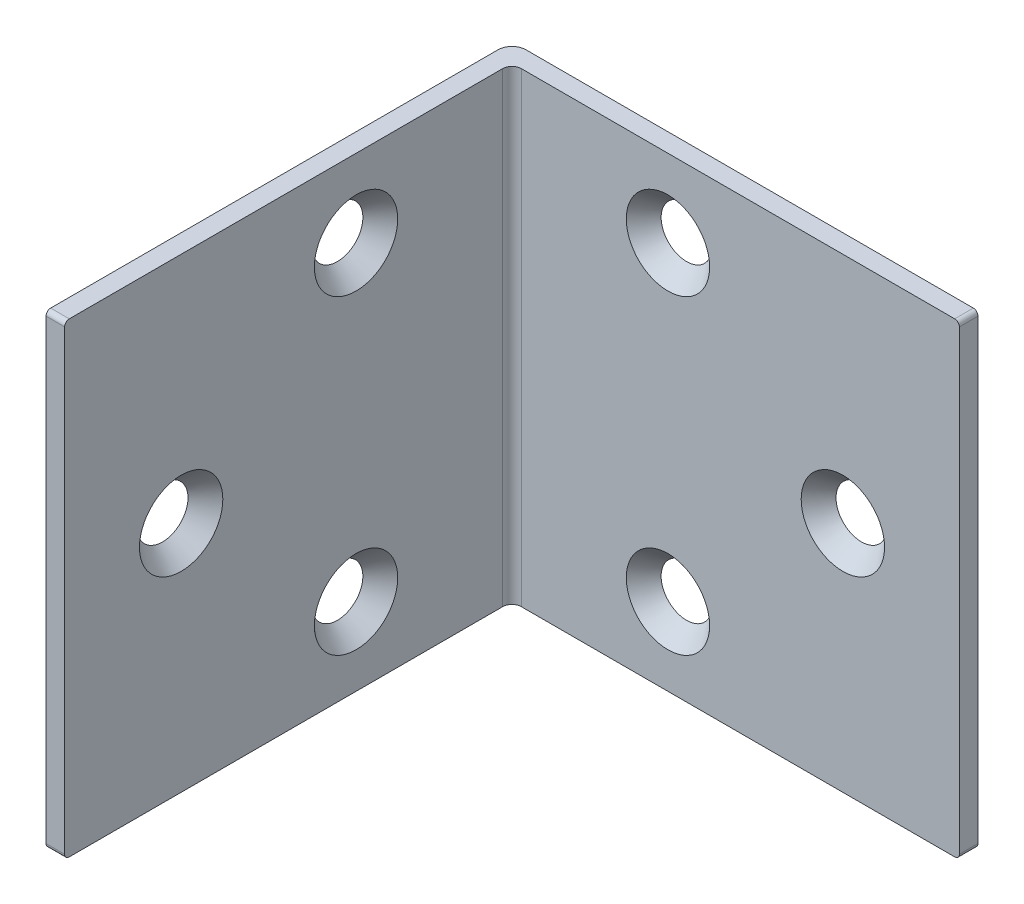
ISO-10303-21;
HEADER;
FILE_DESCRIPTION(('STEP AP214'),'2;1');
FILE_NAME('part.step','',(''),(''),'','','');
FILE_SCHEMA(('AUTOMOTIVE_DESIGN { 1 0 10303 214 1 1 1 1 }'));
ENDSEC;
DATA;
#1=APPLICATION_CONTEXT('core data for automotive mechanical design processes');
#2=APPLICATION_PROTOCOL_DEFINITION('international standard','automotive_design',2000,#1);
#3=PRODUCT_CONTEXT('',#1,'mechanical');
#4=PRODUCT('Part','Part','',(#3));
#5=PRODUCT_RELATED_PRODUCT_CATEGORY('part','',(#4));
#6=PRODUCT_DEFINITION_FORMATION('','',#4);
#7=PRODUCT_DEFINITION_CONTEXT('part definition',#1,'design');
#8=PRODUCT_DEFINITION('design','',#6,#7);
#9=PRODUCT_DEFINITION_SHAPE('','',#8);
#10=(LENGTH_UNIT() NAMED_UNIT(*) SI_UNIT(.MILLI.,.METRE.));
#11=(NAMED_UNIT(*) PLANE_ANGLE_UNIT() SI_UNIT($,.RADIAN.));
#12=(NAMED_UNIT(*) SI_UNIT($,.STERADIAN.) SOLID_ANGLE_UNIT());
#13=UNCERTAINTY_MEASURE_WITH_UNIT(LENGTH_MEASURE(1.E-05),#10,'distance_accuracy_value','');
#14=(GEOMETRIC_REPRESENTATION_CONTEXT(3) GLOBAL_UNCERTAINTY_ASSIGNED_CONTEXT((#13)) GLOBAL_UNIT_ASSIGNED_CONTEXT((#10,
#11,#12)) REPRESENTATION_CONTEXT('',''));
#15=CARTESIAN_POINT('',(0.,0.,0.));
#16=DIRECTION('',(0.,0.,1.));
#17=DIRECTION('',(1.,0.,0.));
#18=AXIS2_PLACEMENT_3D('',#15,#16,#17);
#19=CARTESIAN_POINT('',(0.76200000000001,19.05,37.338));
#20=DIRECTION('',(-1.,0.,0.));
#21=DIRECTION('',(0.,0.,1.));
#22=AXIS2_PLACEMENT_3D('',#19,#20,#21);
#23=PLANE('',#22);
#24=CARTESIAN_POINT('',(0.76200000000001,0.,27.813));
#25=DIRECTION('',(-1.,0.,0.));
#26=DIRECTION('',(0.,0.,1.));
#27=AXIS2_PLACEMENT_3D('',#24,#25,#26);
#28=CIRCLE('',#27,3.40759298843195);
#29=CARTESIAN_POINT('',(0.76200000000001,0.,31.220592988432));
#30=VERTEX_POINT('',#29);
#31=EDGE_CURVE('E231',#30,#30,#28,.T.);
#32=ORIENTED_EDGE('',*,*,#31,.T.);
#33=EDGE_LOOP('',(#32));
#34=FACE_BOUND('',#33,.T.);
#35=CARTESIAN_POINT('',(0.762000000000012,12.7,13.5128));
#36=DIRECTION('',(-1.,0.,0.));
#37=DIRECTION('',(0.,0.,1.));
#38=AXIS2_PLACEMENT_3D('',#35,#36,#37);
#39=CIRCLE('',#38,3.40759298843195);
#40=CARTESIAN_POINT('',(0.762000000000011,12.7,16.920392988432));
#41=VERTEX_POINT('',#40);
#42=EDGE_CURVE('E250',#41,#41,#39,.T.);
#43=ORIENTED_EDGE('',*,*,#42,.T.);
#44=EDGE_LOOP('',(#43));
#45=FACE_BOUND('',#44,.T.);
#46=CARTESIAN_POINT('',(0.762000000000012,-12.7,13.5128));
#47=DIRECTION('',(-1.,0.,0.));
#48=DIRECTION('',(0.,0.,1.));
#49=AXIS2_PLACEMENT_3D('',#46,#47,#48);
#50=CIRCLE('',#49,3.40759298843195);
#51=CARTESIAN_POINT('',(0.762000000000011,-12.7,16.920392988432));
#52=VERTEX_POINT('',#51);
#53=EDGE_CURVE('E243',#52,#52,#50,.T.);
#54=ORIENTED_EDGE('',*,*,#53,.T.);
#55=EDGE_LOOP('',(#54));
#56=FACE_BOUND('',#55,.T.);
#57=DIRECTION('',(0.,-1.,0.));
#58=VECTOR('',#57,1.);
#59=CARTESIAN_POINT('',(0.76200000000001,19.05,37.338));
#60=LINE('',#59,#58);
#61=CARTESIAN_POINT('',(0.76200000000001,18.669,37.338));
#62=VERTEX_POINT('',#61);
#63=CARTESIAN_POINT('',(0.76200000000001,-18.669,37.338));
#64=VERTEX_POINT('',#63);
#65=EDGE_CURVE('E161',#62,#64,#60,.T.);
#66=ORIENTED_EDGE('',*,*,#65,.T.);
#67=CARTESIAN_POINT('',(0.76200000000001,-18.669,36.957));
#68=DIRECTION('',(-1.,0.,0.));
#69=DIRECTION('',(0.,0.,1.));
#70=AXIS2_PLACEMENT_3D('',#67,#68,#69);
#71=CIRCLE('',#70,0.381);
#72=CARTESIAN_POINT('',(0.76200000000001,-19.05,36.957));
#73=VERTEX_POINT('',#72);
#74=EDGE_CURVE('E213',#64,#73,#71,.F.);
#75=ORIENTED_EDGE('',*,*,#74,.T.);
#76=DIRECTION('',(0.,0.,-1.));
#77=VECTOR('',#76,1.);
#78=CARTESIAN_POINT('',(0.76200000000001,-19.05,37.338));
#79=LINE('',#78,#77);
#80=CARTESIAN_POINT('',(0.762000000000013,-19.05,1.52400000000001));
#81=VERTEX_POINT('',#80);
#82=EDGE_CURVE('E228',#73,#81,#79,.T.);
#83=ORIENTED_EDGE('',*,*,#82,.T.);
#84=DIRECTION('',(0.,-1.,0.));
#85=VECTOR('',#84,1.);
#86=CARTESIAN_POINT('',(0.762000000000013,19.05,1.52400000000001));
#87=LINE('',#86,#85);
#88=CARTESIAN_POINT('',(0.762000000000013,19.05,1.52400000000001));
#89=VERTEX_POINT('',#88);
#90=EDGE_CURVE('E177',#81,#89,#87,.F.);
#91=ORIENTED_EDGE('',*,*,#90,.T.);
#92=DIRECTION('',(0.,0.,-1.));
#93=VECTOR('',#92,1.);
#94=CARTESIAN_POINT('',(0.76200000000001,19.05,37.338));
#95=LINE('',#94,#93);
#96=CARTESIAN_POINT('',(0.76200000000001,19.05,36.957));
#97=VERTEX_POINT('',#96);
#98=EDGE_CURVE('E152',#97,#89,#95,.T.);
#99=ORIENTED_EDGE('',*,*,#98,.F.);
#100=CARTESIAN_POINT('',(0.76200000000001,18.669,36.957));
#101=DIRECTION('',(-1.,0.,0.));
#102=DIRECTION('',(0.,0.,1.));
#103=AXIS2_PLACEMENT_3D('',#100,#101,#102);
#104=CIRCLE('',#103,0.381);
#105=EDGE_CURVE('E211',#97,#62,#104,.F.);
#106=ORIENTED_EDGE('',*,*,#105,.T.);
#107=EDGE_LOOP('',(#66,#75,#83,#91,#99,#106));
#108=FACE_BOUND('',#107,.T.);
#109=ADVANCED_FACE('F40',(#34,#45,#56,#108),#23,.F.);
#110=CARTESIAN_POINT('',(0.762000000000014,19.05,0.762000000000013));
#111=DIRECTION('',(0.,0.,-1.));
#112=DIRECTION('',(-1.,0.,0.));
#113=AXIS2_PLACEMENT_3D('',#110,#111,#112);
#114=PLANE('',#113);
#115=CARTESIAN_POINT('',(13.5128,12.7,0.762000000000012));
#116=DIRECTION('',(0.,0.,-1.));
#117=DIRECTION('',(-1.,0.,0.));
#118=AXIS2_PLACEMENT_3D('',#115,#116,#117);
#119=CIRCLE('',#118,3.40759298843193);
#120=CARTESIAN_POINT('',(10.1052070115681,12.7,0.762000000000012));
#121=VERTEX_POINT('',#120);
#122=EDGE_CURVE('E244',#121,#121,#119,.T.);
#123=ORIENTED_EDGE('',*,*,#122,.T.);
#124=EDGE_LOOP('',(#123));
#125=FACE_BOUND('',#124,.T.);
#126=CARTESIAN_POINT('',(13.5128,-12.7,0.762000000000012));
#127=DIRECTION('',(0.,0.,-1.));
#128=DIRECTION('',(-1.,0.,0.));
#129=AXIS2_PLACEMENT_3D('',#126,#127,#128);
#130=CIRCLE('',#129,3.40759298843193);
#131=CARTESIAN_POINT('',(10.1052070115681,-12.7,0.762000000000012));
#132=VERTEX_POINT('',#131);
#133=EDGE_CURVE('E264',#132,#132,#130,.T.);
#134=ORIENTED_EDGE('',*,*,#133,.T.);
#135=EDGE_LOOP('',(#134));
#136=FACE_BOUND('',#135,.T.);
#137=CARTESIAN_POINT('',(27.813,0.,0.762000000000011));
#138=DIRECTION('',(0.,0.,-1.));
#139=DIRECTION('',(-1.,0.,0.));
#140=AXIS2_PLACEMENT_3D('',#137,#138,#139);
#141=CIRCLE('',#140,3.40759298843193);
#142=CARTESIAN_POINT('',(24.4054070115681,0.,0.762000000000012));
#143=VERTEX_POINT('',#142);
#144=EDGE_CURVE('E258',#143,#143,#141,.T.);
#145=ORIENTED_EDGE('',*,*,#144,.T.);
#146=EDGE_LOOP('',(#145));
#147=FACE_BOUND('',#146,.T.);
#148=DIRECTION('',(1.,0.,0.));
#149=VECTOR('',#148,1.);
#150=CARTESIAN_POINT('',(0.762000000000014,-19.05,0.762000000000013));
#151=LINE('',#150,#149);
#152=CARTESIAN_POINT('',(1.52400000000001,-19.05,0.762000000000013));
#153=VERTEX_POINT('',#152);
#154=CARTESIAN_POINT('',(36.957,-19.05,0.762000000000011));
#155=VERTEX_POINT('',#154);
#156=EDGE_CURVE('E157',#153,#155,#151,.T.);
#157=ORIENTED_EDGE('',*,*,#156,.T.);
#158=CARTESIAN_POINT('',(36.957,-18.669,0.762000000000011));
#159=DIRECTION('',(0.,0.,-1.));
#160=DIRECTION('',(-1.,0.,0.));
#161=AXIS2_PLACEMENT_3D('',#158,#159,#160);
#162=CIRCLE('',#161,0.381);
#163=CARTESIAN_POINT('',(37.338,-18.669,0.762000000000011));
#164=VERTEX_POINT('',#163);
#165=EDGE_CURVE('E199',#155,#164,#162,.F.);
#166=ORIENTED_EDGE('',*,*,#165,.T.);
#167=DIRECTION('',(0.,-1.,0.));
#168=VECTOR('',#167,1.);
#169=CARTESIAN_POINT('',(37.338,19.05,0.762000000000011));
#170=LINE('',#169,#168);
#171=CARTESIAN_POINT('',(37.338,18.669,0.762000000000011));
#172=VERTEX_POINT('',#171);
#173=EDGE_CURVE('E146',#172,#164,#170,.T.);
#174=ORIENTED_EDGE('',*,*,#173,.F.);
#175=CARTESIAN_POINT('',(36.957,18.669,0.762000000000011));
#176=DIRECTION('',(0.,0.,-1.));
#177=DIRECTION('',(-1.,0.,0.));
#178=AXIS2_PLACEMENT_3D('',#175,#176,#177);
#179=CIRCLE('',#178,0.381);
#180=CARTESIAN_POINT('',(36.957,19.05,0.762000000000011));
#181=VERTEX_POINT('',#180);
#182=EDGE_CURVE('E197',#172,#181,#179,.F.);
#183=ORIENTED_EDGE('',*,*,#182,.T.);
#184=DIRECTION('',(1.,0.,0.));
#185=VECTOR('',#184,1.);
#186=CARTESIAN_POINT('',(0.762000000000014,19.05,0.762000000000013));
#187=LINE('',#186,#185);
#188=CARTESIAN_POINT('',(1.52400000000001,19.05,0.762000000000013));
#189=VERTEX_POINT('',#188);
#190=EDGE_CURVE('E155',#189,#181,#187,.T.);
#191=ORIENTED_EDGE('',*,*,#190,.F.);
#192=DIRECTION('',(0.,-1.,0.));
#193=VECTOR('',#192,1.);
#194=CARTESIAN_POINT('',(1.52400000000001,-19.05,0.762000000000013));
#195=LINE('',#194,#193);
#196=EDGE_CURVE('E174',#189,#153,#195,.T.);
#197=ORIENTED_EDGE('',*,*,#196,.T.);
#198=EDGE_LOOP('',(#157,#166,#174,#183,#191,#197));
#199=FACE_BOUND('',#198,.T.);
#200=ADVANCED_FACE('F273',(#125,#136,#147,#199),#114,.F.);
#201=CARTESIAN_POINT('',(37.338,19.05,0.762000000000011));
#202=DIRECTION('',(-1.,0.,0.));
#203=DIRECTION('',(0.,0.,1.));
#204=AXIS2_PLACEMENT_3D('',#201,#202,#203);
#205=PLANE('',#204);
#206=ORIENTED_EDGE('',*,*,#173,.T.);
#207=DIRECTION('',(0.,0.,-1.));
#208=VECTOR('',#207,1.);
#209=CARTESIAN_POINT('',(37.338,-18.669,-0.762000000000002));
#210=LINE('',#209,#208);
#211=CARTESIAN_POINT('',(37.338,-18.669,-0.762000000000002));
#212=VERTEX_POINT('',#211);
#213=EDGE_CURVE('E187',#164,#212,#210,.T.);
#214=ORIENTED_EDGE('',*,*,#213,.T.);
#215=DIRECTION('',(0.,-1.,0.));
#216=VECTOR('',#215,1.);
#217=CARTESIAN_POINT('',(37.338,19.05,-0.762000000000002));
#218=LINE('',#217,#216);
#219=CARTESIAN_POINT('',(37.338,18.669,-0.762000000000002));
#220=VERTEX_POINT('',#219);
#221=EDGE_CURVE('E166',#220,#212,#218,.T.);
#222=ORIENTED_EDGE('',*,*,#221,.F.);
#223=DIRECTION('',(0.,0.,-1.));
#224=VECTOR('',#223,1.);
#225=CARTESIAN_POINT('',(37.338,18.669,0.762000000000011));
#226=LINE('',#225,#224);
#227=EDGE_CURVE('E185',#220,#172,#226,.F.);
#228=ORIENTED_EDGE('',*,*,#227,.T.);
#229=EDGE_LOOP('',(#206,#214,#222,#228));
#230=FACE_BOUND('',#229,.T.);
#231=ADVANCED_FACE('F296',(#230),#205,.F.);
#232=CARTESIAN_POINT('',(37.338,19.05,-0.762000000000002));
#233=DIRECTION('',(0.,0.,1.));
#234=DIRECTION('',(1.,0.,0.));
#235=AXIS2_PLACEMENT_3D('',#232,#233,#234);
#236=PLANE('',#235);
#237=CARTESIAN_POINT('',(13.5128,12.7,-0.761999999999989));
#238=DIRECTION('',(0.,0.,1.));
#239=DIRECTION('',(1.,0.,0.));
#240=AXIS2_PLACEMENT_3D('',#237,#238,#239);
#241=CIRCLE('',#240,2.0828);
#242=CARTESIAN_POINT('',(15.5956,12.7,-0.761999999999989));
#243=VERTEX_POINT('',#242);
#244=EDGE_CURVE('E267',#243,#243,#241,.T.);
#245=ORIENTED_EDGE('',*,*,#244,.T.);
#246=EDGE_LOOP('',(#245));
#247=FACE_BOUND('',#246,.T.);
#248=CARTESIAN_POINT('',(13.5128,-12.7,-0.761999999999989));
#249=DIRECTION('',(0.,0.,1.));
#250=DIRECTION('',(1.,0.,0.));
#251=AXIS2_PLACEMENT_3D('',#248,#249,#250);
#252=CIRCLE('',#251,2.0828);
#253=CARTESIAN_POINT('',(15.5956,-12.7,-0.761999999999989));
#254=VERTEX_POINT('',#253);
#255=EDGE_CURVE('E261',#254,#254,#252,.T.);
#256=ORIENTED_EDGE('',*,*,#255,.T.);
#257=EDGE_LOOP('',(#256));
#258=FACE_BOUND('',#257,.T.);
#259=CARTESIAN_POINT('',(27.813,0.,-0.761999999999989));
#260=DIRECTION('',(0.,0.,1.));
#261=DIRECTION('',(1.,0.,0.));
#262=AXIS2_PLACEMENT_3D('',#259,#260,#261);
#263=CIRCLE('',#262,2.0828);
#264=CARTESIAN_POINT('',(29.8958,0.,-0.761999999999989));
#265=VERTEX_POINT('',#264);
#266=EDGE_CURVE('E255',#265,#265,#263,.T.);
#267=ORIENTED_EDGE('',*,*,#266,.T.);
#268=EDGE_LOOP('',(#267));
#269=FACE_BOUND('',#268,.T.);
#270=ORIENTED_EDGE('',*,*,#221,.T.);
#271=CARTESIAN_POINT('',(36.957,-18.669,-0.762000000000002));
#272=DIRECTION('',(0.,0.,1.));
#273=DIRECTION('',(1.,0.,0.));
#274=AXIS2_PLACEMENT_3D('',#271,#272,#273);
#275=CIRCLE('',#274,0.381);
#276=CARTESIAN_POINT('',(36.957,-19.05,-0.762000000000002));
#277=VERTEX_POINT('',#276);
#278=EDGE_CURVE('E192',#212,#277,#275,.F.);
#279=ORIENTED_EDGE('',*,*,#278,.T.);
#280=DIRECTION('',(-1.,0.,0.));
#281=VECTOR('',#280,1.);
#282=CARTESIAN_POINT('',(37.338,-19.05,-0.762000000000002));
#283=LINE('',#282,#281);
#284=CARTESIAN_POINT('',(0.380999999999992,-19.05,-0.761999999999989));
#285=VERTEX_POINT('',#284);
#286=EDGE_CURVE('E153',#277,#285,#283,.T.);
#287=ORIENTED_EDGE('',*,*,#286,.T.);
#288=DIRECTION('',(0.,-1.,0.));
#289=VECTOR('',#288,1.);
#290=CARTESIAN_POINT('',(0.380999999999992,19.05,-0.761999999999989));
#291=LINE('',#290,#289);
#292=CARTESIAN_POINT('',(0.380999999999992,19.05,-0.761999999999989));
#293=VERTEX_POINT('',#292);
#294=EDGE_CURVE('E136',#285,#293,#291,.F.);
#295=ORIENTED_EDGE('',*,*,#294,.T.);
#296=DIRECTION('',(-1.,0.,0.));
#297=VECTOR('',#296,1.);
#298=CARTESIAN_POINT('',(37.338,19.05,-0.762000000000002));
#299=LINE('',#298,#297);
#300=CARTESIAN_POINT('',(36.957,19.05,-0.762000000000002));
#301=VERTEX_POINT('',#300);
#302=EDGE_CURVE('E221',#301,#293,#299,.T.);
#303=ORIENTED_EDGE('',*,*,#302,.F.);
#304=CARTESIAN_POINT('',(36.957,18.669,-0.762000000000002));
#305=DIRECTION('',(0.,0.,1.));
#306=DIRECTION('',(1.,0.,0.));
#307=AXIS2_PLACEMENT_3D('',#304,#305,#306);
#308=CIRCLE('',#307,0.381);
#309=EDGE_CURVE('E190',#301,#220,#308,.F.);
#310=ORIENTED_EDGE('',*,*,#309,.T.);
#311=EDGE_LOOP('',(#270,#279,#287,#295,#303,#310));
#312=FACE_BOUND('',#311,.T.);
#313=ADVANCED_FACE('F341',(#247,#258,#269,#312),#236,.F.);
#314=CARTESIAN_POINT('',(-0.76200000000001,19.05,-0.761999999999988));
#315=DIRECTION('',(1.,0.,0.));
#316=DIRECTION('',(0.,0.,-1.));
#317=AXIS2_PLACEMENT_3D('',#314,#315,#316);
#318=PLANE('',#317);
#319=CARTESIAN_POINT('',(-0.762000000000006,0.,27.813));
#320=DIRECTION('',(1.,0.,0.));
#321=DIRECTION('',(0.,0.,-1.));
#322=AXIS2_PLACEMENT_3D('',#319,#320,#321);
#323=CIRCLE('',#322,2.0828);
#324=CARTESIAN_POINT('',(-0.762000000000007,0.,25.7302));
#325=VERTEX_POINT('',#324);
#326=EDGE_CURVE('E235',#325,#325,#323,.T.);
#327=ORIENTED_EDGE('',*,*,#326,.T.);
#328=EDGE_LOOP('',(#327));
#329=FACE_BOUND('',#328,.T.);
#330=CARTESIAN_POINT('',(-0.762000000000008,12.7,13.5128));
#331=DIRECTION('',(1.,0.,0.));
#332=DIRECTION('',(0.,0.,-1.));
#333=AXIS2_PLACEMENT_3D('',#330,#331,#332);
#334=CIRCLE('',#333,2.0828);
#335=CARTESIAN_POINT('',(-0.762000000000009,12.7,11.43));
#336=VERTEX_POINT('',#335);
#337=EDGE_CURVE('E247',#336,#336,#334,.T.);
#338=ORIENTED_EDGE('',*,*,#337,.T.);
#339=EDGE_LOOP('',(#338));
#340=FACE_BOUND('',#339,.T.);
#341=CARTESIAN_POINT('',(-0.762000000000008,-12.7,13.5128));
#342=DIRECTION('',(1.,0.,0.));
#343=DIRECTION('',(0.,0.,-1.));
#344=AXIS2_PLACEMENT_3D('',#341,#342,#343);
#345=CIRCLE('',#344,2.0828);
#346=CARTESIAN_POINT('',(-0.762000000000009,-12.7,11.43));
#347=VERTEX_POINT('',#346);
#348=EDGE_CURVE('E240',#347,#347,#345,.T.);
#349=ORIENTED_EDGE('',*,*,#348,.T.);
#350=EDGE_LOOP('',(#349));
#351=FACE_BOUND('',#350,.T.);
#352=DIRECTION('',(0.,0.,1.));
#353=VECTOR('',#352,1.);
#354=CARTESIAN_POINT('',(-0.76200000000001,-19.05,-0.761999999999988));
#355=LINE('',#354,#353);
#356=CARTESIAN_POINT('',(-0.76200000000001,-19.05,0.381000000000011));
#357=VERTEX_POINT('',#356);
#358=CARTESIAN_POINT('',(-0.762000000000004,-19.05,36.957));
#359=VERTEX_POINT('',#358);
#360=EDGE_CURVE('E143',#357,#359,#355,.T.);
#361=ORIENTED_EDGE('',*,*,#360,.T.);
#362=CARTESIAN_POINT('',(-0.762000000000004,-18.669,36.957));
#363=DIRECTION('',(1.,0.,0.));
#364=DIRECTION('',(0.,0.,-1.));
#365=AXIS2_PLACEMENT_3D('',#362,#363,#364);
#366=CIRCLE('',#365,0.381);
#367=CARTESIAN_POINT('',(-0.762000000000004,-18.669,37.338));
#368=VERTEX_POINT('',#367);
#369=EDGE_CURVE('E11',#359,#368,#366,.F.);
#370=ORIENTED_EDGE('',*,*,#369,.T.);
#371=DIRECTION('',(0.,-1.,0.));
#372=VECTOR('',#371,1.);
#373=CARTESIAN_POINT('',(-0.762000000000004,19.05,37.338));
#374=LINE('',#373,#372);
#375=CARTESIAN_POINT('',(-0.762000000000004,18.669,37.338));
#376=VERTEX_POINT('',#375);
#377=EDGE_CURVE('E164',#376,#368,#374,.T.);
#378=ORIENTED_EDGE('',*,*,#377,.F.);
#379=CARTESIAN_POINT('',(-0.762000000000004,18.669,36.957));
#380=DIRECTION('',(1.,0.,0.));
#381=DIRECTION('',(0.,0.,-1.));
#382=AXIS2_PLACEMENT_3D('',#379,#380,#381);
#383=CIRCLE('',#382,0.381);
#384=CARTESIAN_POINT('',(-0.762000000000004,19.05,36.957));
#385=VERTEX_POINT('',#384);
#386=EDGE_CURVE('E48',#376,#385,#383,.F.);
#387=ORIENTED_EDGE('',*,*,#386,.T.);
#388=DIRECTION('',(0.,0.,1.));
#389=VECTOR('',#388,1.);
#390=CARTESIAN_POINT('',(-0.76200000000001,19.05,-0.761999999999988));
#391=LINE('',#390,#389);
#392=CARTESIAN_POINT('',(-0.76200000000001,19.05,0.381000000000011));
#393=VERTEX_POINT('',#392);
#394=EDGE_CURVE('E145',#393,#385,#391,.T.);
#395=ORIENTED_EDGE('',*,*,#394,.F.);
#396=DIRECTION('',(0.,-1.,0.));
#397=VECTOR('',#396,1.);
#398=CARTESIAN_POINT('',(-0.76200000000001,19.05,0.381000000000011));
#399=LINE('',#398,#397);
#400=EDGE_CURVE('E134',#393,#357,#399,.T.);
#401=ORIENTED_EDGE('',*,*,#400,.T.);
#402=EDGE_LOOP('',(#361,#370,#378,#387,#395,#401));
#403=FACE_BOUND('',#402,.T.);
#404=ADVANCED_FACE('F142',(#329,#340,#351,#403),#318,.F.);
#405=CARTESIAN_POINT('',(-0.762000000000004,19.05,37.338));
#406=DIRECTION('',(0.,0.,-1.));
#407=DIRECTION('',(-1.,0.,0.));
#408=AXIS2_PLACEMENT_3D('',#405,#406,#407);
#409=PLANE('',#408);
#410=ORIENTED_EDGE('',*,*,#377,.T.);
#411=DIRECTION('',(1.,0.,0.));
#412=VECTOR('',#411,1.);
#413=CARTESIAN_POINT('',(0.76200000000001,-18.669,37.338));
#414=LINE('',#413,#412);
#415=EDGE_CURVE('E208',#368,#64,#414,.T.);
#416=ORIENTED_EDGE('',*,*,#415,.T.);
#417=ORIENTED_EDGE('',*,*,#65,.F.);
#418=DIRECTION('',(1.,0.,0.));
#419=VECTOR('',#418,1.);
#420=CARTESIAN_POINT('',(-0.762000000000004,18.669,37.338));
#421=LINE('',#420,#419);
#422=EDGE_CURVE('E60',#62,#376,#421,.F.);
#423=ORIENTED_EDGE('',*,*,#422,.T.);
#424=EDGE_LOOP('',(#410,#416,#417,#423));
#425=FACE_BOUND('',#424,.T.);
#426=ADVANCED_FACE('F224',(#425),#409,.F.);
#427=CARTESIAN_POINT('',(0.,19.05,0.));
#428=DIRECTION('',(0.,-1.,0.));
#429=DIRECTION('',(0.,0.,-1.));
#430=AXIS2_PLACEMENT_3D('',#427,#428,#429);
#431=PLANE('',#430);
#432=ORIENTED_EDGE('',*,*,#190,.T.);
#433=DIRECTION('',(0.,0.,-1.));
#434=VECTOR('',#433,1.);
#435=CARTESIAN_POINT('',(36.957,19.05,0.));
#436=LINE('',#435,#434);
#437=EDGE_CURVE('E204',#181,#301,#436,.T.);
#438=ORIENTED_EDGE('',*,*,#437,.T.);
#439=ORIENTED_EDGE('',*,*,#302,.T.);
#440=CARTESIAN_POINT('',(0.38099999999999,19.05,0.381000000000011));
#441=DIRECTION('',(0.,-1.,0.));
#442=DIRECTION('',(0.,0.,-1.));
#443=AXIS2_PLACEMENT_3D('',#440,#441,#442);
#444=CIRCLE('',#443,1.143);
#445=EDGE_CURVE('E172',#293,#393,#444,.F.);
#446=ORIENTED_EDGE('',*,*,#445,.T.);
#447=ORIENTED_EDGE('',*,*,#394,.T.);
#448=DIRECTION('',(1.,0.,0.));
#449=VECTOR('',#448,1.);
#450=CARTESIAN_POINT('',(0.,19.05,36.957));
#451=LINE('',#450,#449);
#452=EDGE_CURVE('E201',#385,#97,#451,.T.);
#453=ORIENTED_EDGE('',*,*,#452,.T.);
#454=ORIENTED_EDGE('',*,*,#98,.T.);
#455=CARTESIAN_POINT('',(1.52400000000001,19.05,1.52400000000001));
#456=DIRECTION('',(0.,-1.,0.));
#457=DIRECTION('',(0.,0.,-1.));
#458=AXIS2_PLACEMENT_3D('',#455,#456,#457);
#459=CIRCLE('',#458,0.762);
#460=EDGE_CURVE('E183',#89,#189,#459,.T.);
#461=ORIENTED_EDGE('',*,*,#460,.T.);
#462=EDGE_LOOP('',(#432,#438,#439,#446,#447,#453,#454,#461));
#463=FACE_BOUND('',#462,.T.);
#464=ADVANCED_FACE('F219',(#463),#431,.F.);
#465=CARTESIAN_POINT('',(0.,-19.05,0.));
#466=DIRECTION('',(0.,-1.,0.));
#467=DIRECTION('',(0.,0.,-1.));
#468=AXIS2_PLACEMENT_3D('',#465,#466,#467);
#469=PLANE('',#468);
#470=ORIENTED_EDGE('',*,*,#286,.F.);
#471=DIRECTION('',(0.,0.,-1.));
#472=VECTOR('',#471,1.);
#473=CARTESIAN_POINT('',(36.957,-19.05,0.762000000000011));
#474=LINE('',#473,#472);
#475=EDGE_CURVE('E195',#277,#155,#474,.F.);
#476=ORIENTED_EDGE('',*,*,#475,.T.);
#477=ORIENTED_EDGE('',*,*,#156,.F.);
#478=CARTESIAN_POINT('',(1.52400000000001,-19.05,1.52400000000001));
#479=DIRECTION('',(0.,-1.,0.));
#480=DIRECTION('',(0.,0.,-1.));
#481=AXIS2_PLACEMENT_3D('',#478,#479,#480);
#482=CIRCLE('',#481,0.762);
#483=EDGE_CURVE('E180',#153,#81,#482,.F.);
#484=ORIENTED_EDGE('',*,*,#483,.T.);
#485=ORIENTED_EDGE('',*,*,#82,.F.);
#486=DIRECTION('',(1.,0.,0.));
#487=VECTOR('',#486,1.);
#488=CARTESIAN_POINT('',(-0.762000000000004,-19.05,36.957));
#489=LINE('',#488,#487);
#490=EDGE_CURVE('E151',#73,#359,#489,.F.);
#491=ORIENTED_EDGE('',*,*,#490,.T.);
#492=ORIENTED_EDGE('',*,*,#360,.F.);
#493=CARTESIAN_POINT('',(0.38099999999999,-19.05,0.381000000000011));
#494=DIRECTION('',(0.,-1.,0.));
#495=DIRECTION('',(0.,0.,-1.));
#496=AXIS2_PLACEMENT_3D('',#493,#494,#495);
#497=CIRCLE('',#496,1.143);
#498=EDGE_CURVE('E130',#357,#285,#497,.T.);
#499=ORIENTED_EDGE('',*,*,#498,.T.);
#500=EDGE_LOOP('',(#470,#476,#477,#484,#485,#491,#492,#499));
#501=FACE_BOUND('',#500,.T.);
#502=ADVANCED_FACE('F148',(#501),#469,.T.);
#503=CARTESIAN_POINT('',(0.38099999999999,19.05,0.381000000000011));
#504=DIRECTION('',(0.,-1.,0.));
#505=DIRECTION('',(0.,0.,-1.));
#506=AXIS2_PLACEMENT_3D('',#503,#504,#505);
#507=CYLINDRICAL_SURFACE('',#506,1.143);
#508=ORIENTED_EDGE('',*,*,#445,.F.);
#509=ORIENTED_EDGE('',*,*,#294,.F.);
#510=ORIENTED_EDGE('',*,*,#498,.F.);
#511=ORIENTED_EDGE('',*,*,#400,.F.);
#512=EDGE_LOOP('',(#508,#509,#510,#511));
#513=FACE_BOUND('',#512,.T.);
#514=ADVANCED_FACE('F133',(#513),#507,.T.);
#515=CARTESIAN_POINT('',(1.52400000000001,19.05,1.52400000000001));
#516=DIRECTION('',(0.,1.,0.));
#517=DIRECTION('',(0.,0.,1.));
#518=AXIS2_PLACEMENT_3D('',#515,#516,#517);
#519=CYLINDRICAL_SURFACE('',#518,0.762);
#520=ORIENTED_EDGE('',*,*,#460,.F.);
#521=ORIENTED_EDGE('',*,*,#90,.F.);
#522=ORIENTED_EDGE('',*,*,#483,.F.);
#523=ORIENTED_EDGE('',*,*,#196,.F.);
#524=EDGE_LOOP('',(#520,#521,#522,#523));
#525=FACE_BOUND('',#524,.T.);
#526=ADVANCED_FACE('F303',(#525),#519,.F.);
#527=CARTESIAN_POINT('',(36.957,-18.669,0.762000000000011));
#528=DIRECTION('',(0.,0.,1.));
#529=DIRECTION('',(1.,0.,0.));
#530=AXIS2_PLACEMENT_3D('',#527,#528,#529);
#531=CYLINDRICAL_SURFACE('',#530,0.381);
#532=ORIENTED_EDGE('',*,*,#165,.F.);
#533=ORIENTED_EDGE('',*,*,#475,.F.);
#534=ORIENTED_EDGE('',*,*,#278,.F.);
#535=ORIENTED_EDGE('',*,*,#213,.F.);
#536=EDGE_LOOP('',(#532,#533,#534,#535));
#537=FACE_BOUND('',#536,.T.);
#538=ADVANCED_FACE('F306',(#537),#531,.T.);
#539=CARTESIAN_POINT('',(36.957,18.669,0.));
#540=DIRECTION('',(0.,0.,-1.));
#541=DIRECTION('',(-1.,0.,0.));
#542=AXIS2_PLACEMENT_3D('',#539,#540,#541);
#543=CYLINDRICAL_SURFACE('',#542,0.381);
#544=ORIENTED_EDGE('',*,*,#182,.F.);
#545=ORIENTED_EDGE('',*,*,#227,.F.);
#546=ORIENTED_EDGE('',*,*,#309,.F.);
#547=ORIENTED_EDGE('',*,*,#437,.F.);
#548=EDGE_LOOP('',(#544,#545,#546,#547));
#549=FACE_BOUND('',#548,.T.);
#550=ADVANCED_FACE('F310',(#549),#543,.T.);
#551=CARTESIAN_POINT('',(-0.762000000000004,-18.669,36.957));
#552=DIRECTION('',(-1.,0.,0.));
#553=DIRECTION('',(0.,0.,1.));
#554=AXIS2_PLACEMENT_3D('',#551,#552,#553);
#555=CYLINDRICAL_SURFACE('',#554,0.381);
#556=ORIENTED_EDGE('',*,*,#369,.F.);
#557=ORIENTED_EDGE('',*,*,#490,.F.);
#558=ORIENTED_EDGE('',*,*,#74,.F.);
#559=ORIENTED_EDGE('',*,*,#415,.F.);
#560=EDGE_LOOP('',(#556,#557,#558,#559));
#561=FACE_BOUND('',#560,.T.);
#562=ADVANCED_FACE('F227',(#561),#555,.T.);
#563=CARTESIAN_POINT('',(0.,18.669,36.957));
#564=DIRECTION('',(1.,0.,0.));
#565=DIRECTION('',(0.,0.,-1.));
#566=AXIS2_PLACEMENT_3D('',#563,#564,#565);
#567=CYLINDRICAL_SURFACE('',#566,0.381);
#568=ORIENTED_EDGE('',*,*,#386,.F.);
#569=ORIENTED_EDGE('',*,*,#422,.F.);
#570=ORIENTED_EDGE('',*,*,#105,.F.);
#571=ORIENTED_EDGE('',*,*,#452,.F.);
#572=EDGE_LOOP('',(#568,#569,#570,#571));
#573=FACE_BOUND('',#572,.T.);
#574=ADVANCED_FACE('F42',(#573),#567,.T.);
#575=CARTESIAN_POINT('',(-0.762000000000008,-12.7,13.5128));
#576=DIRECTION('',(1.,0.,0.));
#577=DIRECTION('',(0.,0.,-1.));
#578=AXIS2_PLACEMENT_3D('',#575,#576,#577);
#579=CONICAL_SURFACE('',#578,2.0828,0.715584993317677);
#580=ORIENTED_EDGE('',*,*,#348,.F.);
#581=EDGE_LOOP('',(#580));
#582=FACE_BOUND('',#581,.T.);
#583=ORIENTED_EDGE('',*,*,#53,.F.);
#584=EDGE_LOOP('',(#583));
#585=FACE_BOUND('',#584,.T.);
#586=ADVANCED_FACE('F317',(#582,#585),#579,.F.);
#587=CARTESIAN_POINT('',(-0.762000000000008,12.7,13.5128));
#588=DIRECTION('',(1.,0.,0.));
#589=DIRECTION('',(0.,0.,-1.));
#590=AXIS2_PLACEMENT_3D('',#587,#588,#589);
#591=CONICAL_SURFACE('',#590,2.0828,0.715584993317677);
#592=ORIENTED_EDGE('',*,*,#337,.F.);
#593=EDGE_LOOP('',(#592));
#594=FACE_BOUND('',#593,.T.);
#595=ORIENTED_EDGE('',*,*,#42,.F.);
#596=EDGE_LOOP('',(#595));
#597=FACE_BOUND('',#596,.T.);
#598=ADVANCED_FACE('F321',(#594,#597),#591,.F.);
#599=CARTESIAN_POINT('',(-0.762000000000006,0.,27.813));
#600=DIRECTION('',(1.,0.,0.));
#601=DIRECTION('',(0.,0.,-1.));
#602=AXIS2_PLACEMENT_3D('',#599,#600,#601);
#603=CONICAL_SURFACE('',#602,2.0828,0.715584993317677);
#604=ORIENTED_EDGE('',*,*,#326,.F.);
#605=EDGE_LOOP('',(#604));
#606=FACE_BOUND('',#605,.T.);
#607=ORIENTED_EDGE('',*,*,#31,.F.);
#608=EDGE_LOOP('',(#607));
#609=FACE_BOUND('',#608,.T.);
#610=ADVANCED_FACE('F327',(#606,#609),#603,.F.);
#611=CARTESIAN_POINT('',(27.813,0.,-0.761999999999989));
#612=DIRECTION('',(0.,0.,1.));
#613=DIRECTION('',(1.,0.,0.));
#614=AXIS2_PLACEMENT_3D('',#611,#612,#613);
#615=CONICAL_SURFACE('',#614,2.0828,0.715584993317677);
#616=ORIENTED_EDGE('',*,*,#266,.F.);
#617=EDGE_LOOP('',(#616));
#618=FACE_BOUND('',#617,.T.);
#619=ORIENTED_EDGE('',*,*,#144,.F.);
#620=EDGE_LOOP('',(#619));
#621=FACE_BOUND('',#620,.T.);
#622=ADVANCED_FACE('F284',(#618,#621),#615,.F.);
#623=CARTESIAN_POINT('',(13.5128,-12.7,-0.761999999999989));
#624=DIRECTION('',(0.,0.,1.));
#625=DIRECTION('',(1.,0.,0.));
#626=AXIS2_PLACEMENT_3D('',#623,#624,#625);
#627=CONICAL_SURFACE('',#626,2.0828,0.715584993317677);
#628=ORIENTED_EDGE('',*,*,#255,.F.);
#629=EDGE_LOOP('',(#628));
#630=FACE_BOUND('',#629,.T.);
#631=ORIENTED_EDGE('',*,*,#133,.F.);
#632=EDGE_LOOP('',(#631));
#633=FACE_BOUND('',#632,.T.);
#634=ADVANCED_FACE('F278',(#630,#633),#627,.F.);
#635=CARTESIAN_POINT('',(13.5128,12.7,-0.761999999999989));
#636=DIRECTION('',(0.,0.,1.));
#637=DIRECTION('',(1.,0.,0.));
#638=AXIS2_PLACEMENT_3D('',#635,#636,#637);
#639=CONICAL_SURFACE('',#638,2.0828,0.715584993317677);
#640=ORIENTED_EDGE('',*,*,#244,.F.);
#641=EDGE_LOOP('',(#640));
#642=FACE_BOUND('',#641,.T.);
#643=ORIENTED_EDGE('',*,*,#122,.F.);
#644=EDGE_LOOP('',(#643));
#645=FACE_BOUND('',#644,.T.);
#646=ADVANCED_FACE('F276',(#642,#645),#639,.F.);
#647=CLOSED_SHELL('',(#109,#200,#231,#313,#404,#426,#464,#502,#514,#526,#538,#550,#562,#574,
#586,#598,#610,#622,#634,#646));
#648=MANIFOLD_SOLID_BREP('B2',#647);
#649=ADVANCED_BREP_SHAPE_REPRESENTATION('',(#18,#648),#14);
#650=SHAPE_DEFINITION_REPRESENTATION(#9,#649);
ENDSEC;
END-ISO-10303-21;
